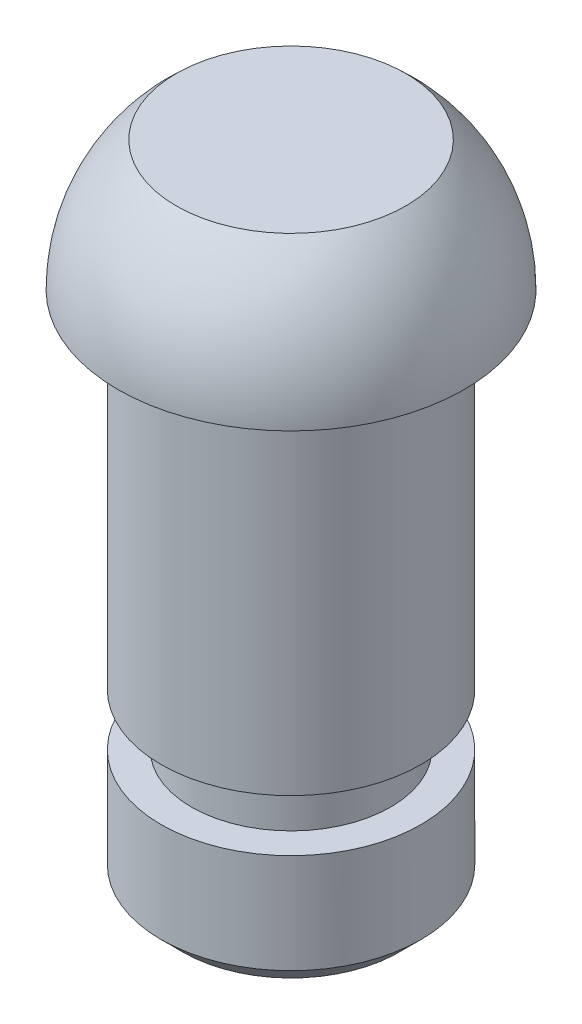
ISO-10303-21;
HEADER;
FILE_DESCRIPTION(('STEP AP214'),'2;1');
FILE_NAME('part.step','',(''),(''),'','','');
FILE_SCHEMA(('AUTOMOTIVE_DESIGN { 1 0 10303 214 1 1 1 1 }'));
ENDSEC;
DATA;
#1=APPLICATION_CONTEXT('core data for automotive mechanical design processes');
#2=APPLICATION_PROTOCOL_DEFINITION('international standard','automotive_design',2000,#1);
#3=PRODUCT_CONTEXT('',#1,'mechanical');
#4=PRODUCT('Part','Part','',(#3));
#5=PRODUCT_RELATED_PRODUCT_CATEGORY('part','',(#4));
#6=PRODUCT_DEFINITION_FORMATION('','',#4);
#7=PRODUCT_DEFINITION_CONTEXT('part definition',#1,'design');
#8=PRODUCT_DEFINITION('design','',#6,#7);
#9=PRODUCT_DEFINITION_SHAPE('','',#8);
#10=(LENGTH_UNIT() NAMED_UNIT(*) SI_UNIT(.MILLI.,.METRE.));
#11=(NAMED_UNIT(*) PLANE_ANGLE_UNIT() SI_UNIT($,.RADIAN.));
#12=(NAMED_UNIT(*) SI_UNIT($,.STERADIAN.) SOLID_ANGLE_UNIT());
#13=UNCERTAINTY_MEASURE_WITH_UNIT(LENGTH_MEASURE(1.E-05),#10,'distance_accuracy_value','');
#14=(GEOMETRIC_REPRESENTATION_CONTEXT(3) GLOBAL_UNCERTAINTY_ASSIGNED_CONTEXT((#13)) GLOBAL_UNIT_ASSIGNED_CONTEXT((#10,
#11,#12)) REPRESENTATION_CONTEXT('',''));
#15=CARTESIAN_POINT('',(0.,0.,0.));
#16=DIRECTION('',(0.,0.,1.));
#17=DIRECTION('',(1.,0.,0.));
#18=AXIS2_PLACEMENT_3D('',#15,#16,#17);
#19=CARTESIAN_POINT('',(-1.325,2.76692963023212,0.));
#20=DIRECTION('',(0.,1.,0.));
#21=DIRECTION('',(0.,0.,1.));
#22=AXIS2_PLACEMENT_3D('',#19,#20,#21);
#23=PLANE('',#22);
#24=CARTESIAN_POINT('',(0.,2.76692963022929,0.));
#25=DIRECTION('',(0.,1.,0.));
#26=DIRECTION('',(0.,0.,1.));
#27=AXIS2_PLACEMENT_3D('',#24,#25,#26);
#28=CIRCLE('',#27,1.325);
#29=CARTESIAN_POINT('',(0.,2.76692963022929,1.325));
#30=VERTEX_POINT('',#29);
#31=EDGE_CURVE('E45',#30,#30,#28,.T.);
#32=ORIENTED_EDGE('',*,*,#31,.T.);
#33=EDGE_LOOP('',(#32));
#34=FACE_BOUND('',#33,.T.);
#35=ADVANCED_FACE('F33',(#34),#23,.T.);
#36=CARTESIAN_POINT('',(0.,1.26880580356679,0.));
#37=DIRECTION('',(0.,1.,0.));
#38=DIRECTION('',(-1.,0.,0.));
#39=AXIS2_PLACEMENT_3D('',#36,#37,#38);
#40=SPHERICAL_SURFACE('',#39,2.00000000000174);
#41=CARTESIAN_POINT('',(0.,1.26880580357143,0.));
#42=DIRECTION('',(0.,1.,0.));
#43=DIRECTION('',(0.,0.,1.));
#44=AXIS2_PLACEMENT_3D('',#41,#42,#43);
#45=CIRCLE('',#44,2.00000000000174);
#46=CARTESIAN_POINT('',(0.,1.26880580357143,2.00000000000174));
#47=VERTEX_POINT('',#46);
#48=EDGE_CURVE('E49',#47,#47,#45,.T.);
#49=ORIENTED_EDGE('',*,*,#48,.T.);
#50=EDGE_LOOP('',(#49));
#51=FACE_BOUND('',#50,.T.);
#52=ORIENTED_EDGE('',*,*,#31,.F.);
#53=EDGE_LOOP('',(#52));
#54=FACE_BOUND('',#53,.T.);
#55=ADVANCED_FACE('F85',(#51,#54),#40,.T.);
#56=CARTESIAN_POINT('',(-2.,1.26880580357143,0.));
#57=DIRECTION('',(0.,-1.,0.));
#58=DIRECTION('',(0.,0.,-1.));
#59=AXIS2_PLACEMENT_3D('',#56,#57,#58);
#60=PLANE('',#59);
#61=CARTESIAN_POINT('',(0.,1.26880580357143,0.));
#62=DIRECTION('',(0.,1.,0.));
#63=DIRECTION('',(0.,0.,1.));
#64=AXIS2_PLACEMENT_3D('',#61,#62,#63);
#65=CIRCLE('',#64,1.5);
#66=CARTESIAN_POINT('',(0.,1.26880580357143,1.5));
#67=VERTEX_POINT('',#66);
#68=EDGE_CURVE('E54',#67,#67,#65,.T.);
#69=ORIENTED_EDGE('',*,*,#68,.T.);
#70=EDGE_LOOP('',(#69));
#71=FACE_BOUND('',#70,.T.);
#72=ORIENTED_EDGE('',*,*,#48,.F.);
#73=EDGE_LOOP('',(#72));
#74=FACE_BOUND('',#73,.T.);
#75=ADVANCED_FACE('F90',(#71,#74),#60,.T.);
#76=CARTESIAN_POINT('',(0.,0.,0.));
#77=DIRECTION('',(0.,1.,0.));
#78=DIRECTION('',(0.,0.,1.));
#79=AXIS2_PLACEMENT_3D('',#76,#77,#78);
#80=CYLINDRICAL_SURFACE('',#79,1.5);
#81=CARTESIAN_POINT('',(0.,-2.73119419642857,0.));
#82=DIRECTION('',(0.,1.,0.));
#83=DIRECTION('',(0.,0.,1.));
#84=AXIS2_PLACEMENT_3D('',#81,#82,#83);
#85=CIRCLE('',#84,1.5);
#86=CARTESIAN_POINT('',(0.,-2.73119419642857,1.5));
#87=VERTEX_POINT('',#86);
#88=EDGE_CURVE('E57',#87,#87,#85,.T.);
#89=ORIENTED_EDGE('',*,*,#88,.T.);
#90=EDGE_LOOP('',(#89));
#91=FACE_BOUND('',#90,.T.);
#92=ORIENTED_EDGE('',*,*,#68,.F.);
#93=EDGE_LOOP('',(#92));
#94=FACE_BOUND('',#93,.T.);
#95=ADVANCED_FACE('F96',(#91,#94),#80,.T.);
#96=CARTESIAN_POINT('',(-1.5,-2.73119419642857,0.));
#97=DIRECTION('',(0.,-1.,0.));
#98=DIRECTION('',(0.,0.,-1.));
#99=AXIS2_PLACEMENT_3D('',#96,#97,#98);
#100=PLANE('',#99);
#101=CARTESIAN_POINT('',(0.,-2.73119419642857,0.));
#102=DIRECTION('',(0.,1.,0.));
#103=DIRECTION('',(0.,0.,1.));
#104=AXIS2_PLACEMENT_3D('',#101,#102,#103);
#105=CIRCLE('',#104,1.15);
#106=CARTESIAN_POINT('',(0.,-2.73119419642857,1.15));
#107=VERTEX_POINT('',#106);
#108=EDGE_CURVE('E60',#107,#107,#105,.T.);
#109=ORIENTED_EDGE('',*,*,#108,.T.);
#110=EDGE_LOOP('',(#109));
#111=FACE_BOUND('',#110,.T.);
#112=ORIENTED_EDGE('',*,*,#88,.F.);
#113=EDGE_LOOP('',(#112));
#114=FACE_BOUND('',#113,.T.);
#115=ADVANCED_FACE('F100',(#111,#114),#100,.T.);
#116=CARTESIAN_POINT('',(0.,0.,0.));
#117=DIRECTION('',(0.,1.,0.));
#118=DIRECTION('',(0.,0.,1.));
#119=AXIS2_PLACEMENT_3D('',#116,#117,#118);
#120=CYLINDRICAL_SURFACE('',#119,1.15);
#121=CARTESIAN_POINT('',(0.,-3.33119419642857,0.));
#122=DIRECTION('',(0.,1.,0.));
#123=DIRECTION('',(0.,0.,1.));
#124=AXIS2_PLACEMENT_3D('',#121,#122,#123);
#125=CIRCLE('',#124,1.15);
#126=CARTESIAN_POINT('',(0.,-3.33119419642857,1.15));
#127=VERTEX_POINT('',#126);
#128=EDGE_CURVE('E63',#127,#127,#125,.T.);
#129=ORIENTED_EDGE('',*,*,#128,.T.);
#130=EDGE_LOOP('',(#129));
#131=FACE_BOUND('',#130,.T.);
#132=ORIENTED_EDGE('',*,*,#108,.F.);
#133=EDGE_LOOP('',(#132));
#134=FACE_BOUND('',#133,.T.);
#135=ADVANCED_FACE('F82',(#131,#134),#120,.T.);
#136=CARTESIAN_POINT('',(-1.15,-3.33119419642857,0.));
#137=DIRECTION('',(0.,1.,0.));
#138=DIRECTION('',(0.,0.,1.));
#139=AXIS2_PLACEMENT_3D('',#136,#137,#138);
#140=PLANE('',#139);
#141=CARTESIAN_POINT('',(0.,-3.33119419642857,0.));
#142=DIRECTION('',(0.,1.,0.));
#143=DIRECTION('',(0.,0.,1.));
#144=AXIS2_PLACEMENT_3D('',#141,#142,#143);
#145=CIRCLE('',#144,1.5);
#146=CARTESIAN_POINT('',(0.,-3.33119419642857,1.5));
#147=VERTEX_POINT('',#146);
#148=EDGE_CURVE('E66',#147,#147,#145,.T.);
#149=ORIENTED_EDGE('',*,*,#148,.T.);
#150=EDGE_LOOP('',(#149));
#151=FACE_BOUND('',#150,.T.);
#152=ORIENTED_EDGE('',*,*,#128,.F.);
#153=EDGE_LOOP('',(#152));
#154=FACE_BOUND('',#153,.T.);
#155=ADVANCED_FACE('F70',(#151,#154),#140,.T.);
#156=CARTESIAN_POINT('',(0.,0.,0.));
#157=DIRECTION('',(0.,1.,0.));
#158=DIRECTION('',(0.,0.,1.));
#159=AXIS2_PLACEMENT_3D('',#156,#157,#158);
#160=CYLINDRICAL_SURFACE('',#159,1.5);
#161=CARTESIAN_POINT('',(0.,-4.48119419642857,0.));
#162=DIRECTION('',(0.,-1.,0.));
#163=DIRECTION('',(0.,0.,-1.));
#164=AXIS2_PLACEMENT_3D('',#161,#162,#163);
#165=CIRCLE('',#164,1.5);
#166=CARTESIAN_POINT('',(0.,-4.48119419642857,-1.5));
#167=VERTEX_POINT('',#166);
#168=EDGE_CURVE('E41',#167,#167,#165,.F.);
#169=ORIENTED_EDGE('',*,*,#168,.T.);
#170=EDGE_LOOP('',(#169));
#171=FACE_BOUND('',#170,.T.);
#172=ORIENTED_EDGE('',*,*,#148,.F.);
#173=EDGE_LOOP('',(#172));
#174=FACE_BOUND('',#173,.T.);
#175=ADVANCED_FACE('F73',(#171,#174),#160,.T.);
#176=CARTESIAN_POINT('',(-1.5,-4.73119419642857,0.));
#177=DIRECTION('',(0.,-1.,0.));
#178=DIRECTION('',(0.,0.,-1.));
#179=AXIS2_PLACEMENT_3D('',#176,#177,#178);
#180=PLANE('',#179);
#181=CARTESIAN_POINT('',(0.,-4.73119419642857,0.));
#182=DIRECTION('',(0.,-1.,0.));
#183=DIRECTION('',(0.,0.,-1.));
#184=AXIS2_PLACEMENT_3D('',#181,#182,#183);
#185=CIRCLE('',#184,1.25);
#186=CARTESIAN_POINT('',(0.,-4.73119419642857,-1.25));
#187=VERTEX_POINT('',#186);
#188=EDGE_CURVE('E10',#187,#187,#185,.T.);
#189=ORIENTED_EDGE('',*,*,#188,.T.);
#190=EDGE_LOOP('',(#189));
#191=FACE_BOUND('',#190,.T.);
#192=ADVANCED_FACE('F75',(#191),#180,.T.);
#193=CARTESIAN_POINT('',(0.,-4.48119419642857,0.));
#194=DIRECTION('',(0.,1.,0.));
#195=DIRECTION('',(0.,0.,1.));
#196=AXIS2_PLACEMENT_3D('',#193,#194,#195);
#197=CONICAL_SURFACE('',#196,1.5,0.78539816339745);
#198=ORIENTED_EDGE('',*,*,#188,.F.);
#199=EDGE_LOOP('',(#198));
#200=FACE_BOUND('',#199,.T.);
#201=ORIENTED_EDGE('',*,*,#168,.F.);
#202=EDGE_LOOP('',(#201));
#203=FACE_BOUND('',#202,.T.);
#204=ADVANCED_FACE('F36',(#200,#203),#197,.T.);
#205=CLOSED_SHELL('',(#35,#55,#75,#95,#115,#135,#155,#175,#192,#204));
#206=MANIFOLD_SOLID_BREP('B2',#205);
#207=ADVANCED_BREP_SHAPE_REPRESENTATION('',(#18,#206),#14);
#208=SHAPE_DEFINITION_REPRESENTATION(#9,#207);
ENDSEC;
END-ISO-10303-21;
